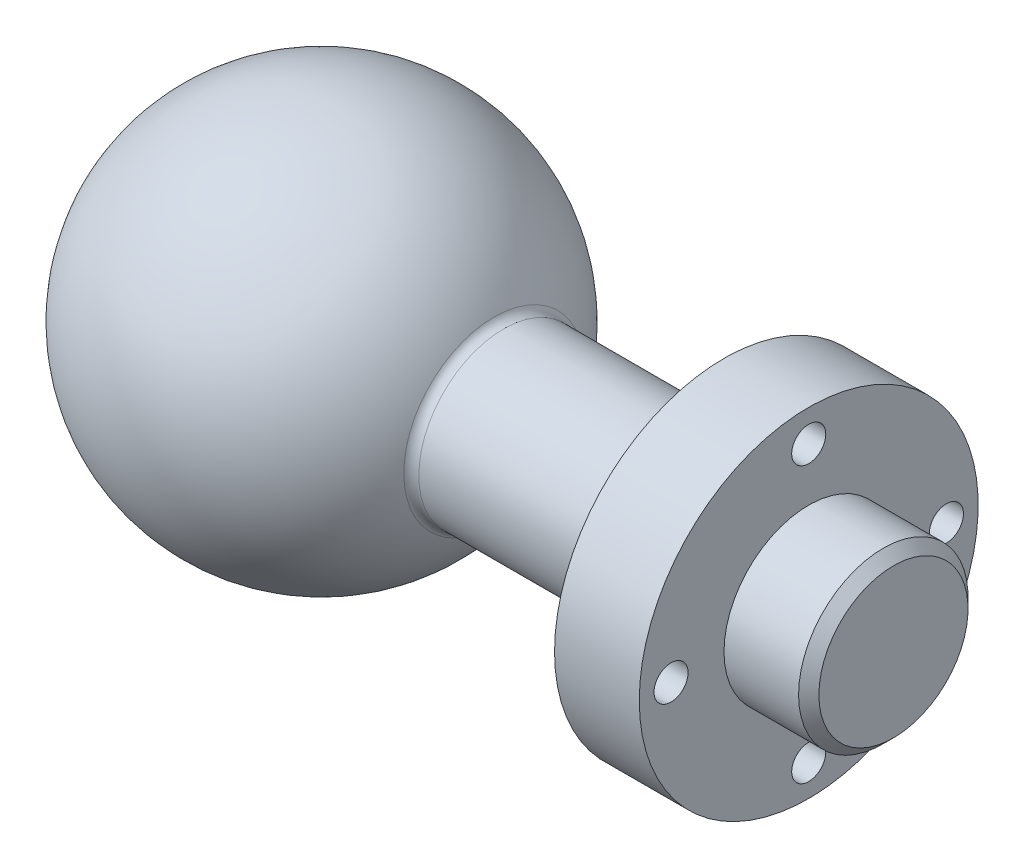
from build123d import *

# Parameters (mm, degrees)
F_1_4_20_TAPPED_HOLE1_D     = 5.1054
F_1_4_20_TAPPED_HOLE1_DEPTH = 12.7
FILLET1_R                   = 1.5875
CHAMFER1_SIZE               = 1.524


with BuildPart() as part:
    # Sketch1 → Revolve1 (revolve)
    with BuildSketch(Plane.XY, mode=Mode.PRIVATE) as revolve1_sk:
        with BuildLine():
            Line((26.304640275, 12.7), (60.325, 12.7))
            Line((60.325, 12.7), (60.325, 25.4))
            Line((60.325, 25.4), (73.025, 25.4))
            Line((73.025, 25.4), (73.025, 12.7))
            Line((73.025, 12.7), (85.725, 12.7))
            Line((85.725, 12.7), (85.725, 0))
            Line((85.725, 0), (-29.21, 0))
            ThreePointArc((-29.21, 0), (-6.514044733, 28.474397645), (26.304640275, 12.7))
        make_face()
    revolve(revolve1_sk.sketch.rotate(Axis((-88.99, 0, 0), (1, 0, 0)), 90), axis=Axis((-88.99, 0, 0), (1, 0, 0)))

    # 1_4-20 Tapped Hole1
    with Locations(Plane(origin=(73.025, 0, 0), x_dir=(0, 0, -1), z_dir=(1, 0, 0))):
        with Locations((-20.6375, 0), (0, 20.6375), (20.6375, 0), (0, -20.6375)):
            Hole(F_1_4_20_TAPPED_HOLE1_D / 2, depth=F_1_4_20_TAPPED_HOLE1_DEPTH)

    # Fillet1
    fillet1_edges = [part.edges().sort_by_distance(p)[0] for p in [
        (26.304640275, 0, -12.7),
        (60.325, 0, -12.7),
    ]]
    fillet(fillet1_edges, radius=FILLET1_R)

    # Chamfer1
    chamfer1_edges = [part.edges().sort_by_distance(p)[0] for p in [
        (85.725, 0, -12.7),
    ]]
    chamfer(chamfer1_edges, length=CHAMFER1_SIZE)


solid = part.part
